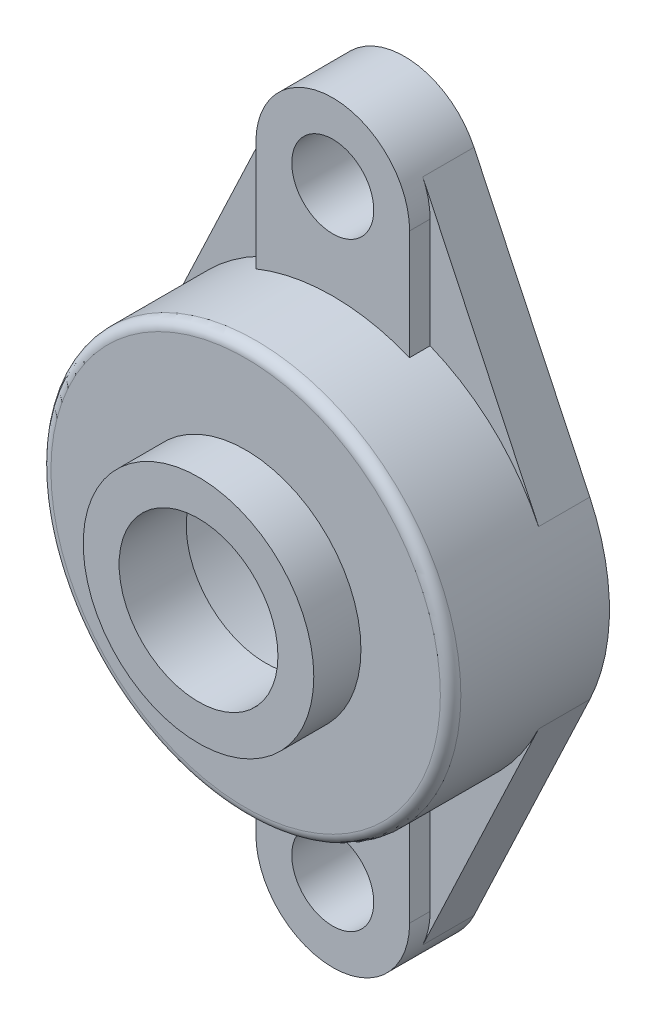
ISO-10303-21;
HEADER;
FILE_DESCRIPTION(('STEP AP214'),'2;1');
FILE_NAME('part.step','',(''),(''),'','','');
FILE_SCHEMA(('AUTOMOTIVE_DESIGN { 1 0 10303 214 1 1 1 1 }'));
ENDSEC;
DATA;
#1=APPLICATION_CONTEXT('core data for automotive mechanical design processes');
#2=APPLICATION_PROTOCOL_DEFINITION('international standard','automotive_design',2000,#1);
#3=PRODUCT_CONTEXT('',#1,'mechanical');
#4=PRODUCT('Part','Part','',(#3));
#5=PRODUCT_RELATED_PRODUCT_CATEGORY('part','',(#4));
#6=PRODUCT_DEFINITION_FORMATION('','',#4);
#7=PRODUCT_DEFINITION_CONTEXT('part definition',#1,'design');
#8=PRODUCT_DEFINITION('design','',#6,#7);
#9=PRODUCT_DEFINITION_SHAPE('','',#8);
#10=(LENGTH_UNIT() NAMED_UNIT(*) SI_UNIT(.MILLI.,.METRE.));
#11=(NAMED_UNIT(*) PLANE_ANGLE_UNIT() SI_UNIT($,.RADIAN.));
#12=(NAMED_UNIT(*) SI_UNIT($,.STERADIAN.) SOLID_ANGLE_UNIT());
#13=UNCERTAINTY_MEASURE_WITH_UNIT(LENGTH_MEASURE(1.E-05),#10,'distance_accuracy_value','');
#14=(GEOMETRIC_REPRESENTATION_CONTEXT(3) GLOBAL_UNCERTAINTY_ASSIGNED_CONTEXT((#13)) GLOBAL_UNIT_ASSIGNED_CONTEXT((#10,
#11,#12)) REPRESENTATION_CONTEXT('',''));
#15=CARTESIAN_POINT('',(0.,0.,0.));
#16=DIRECTION('',(0.,0.,1.));
#17=DIRECTION('',(1.,0.,0.));
#18=AXIS2_PLACEMENT_3D('',#15,#16,#17);
#19=CARTESIAN_POINT('',(0.,0.,-2.50000000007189E-05));
#20=DIRECTION('',(0.,0.,1.));
#21=DIRECTION('',(1.,0.,0.));
#22=AXIS2_PLACEMENT_3D('',#19,#20,#21);
#23=CYLINDRICAL_SURFACE('',#22,15.5);
#24=CARTESIAN_POINT('',(0.,0.,40.2));
#25=DIRECTION('',(0.,0.,1.));
#26=DIRECTION('',(1.,0.,0.));
#27=AXIS2_PLACEMENT_3D('',#24,#25,#26);
#28=CIRCLE('',#27,15.5);
#29=CARTESIAN_POINT('',(15.5,0.,40.2));
#30=VERTEX_POINT('',#29);
#31=EDGE_CURVE('E415',#30,#30,#28,.T.);
#32=CARTESIAN_POINT('',(0.,0.,27.1));
#33=DIRECTION('',(0.,0.,-1.));
#34=DIRECTION('',(0.,1.,0.));
#35=AXIS2_PLACEMENT_3D('',#32,#33,#34);
#36=CIRCLE('',#35,15.5);
#37=CARTESIAN_POINT('',(15.5,0.,27.1));
#38=VERTEX_POINT('',#37);
#39=EDGE_CURVE('E37',#38,#38,#36,.F.);
#40=CARTESIAN_POINT('',(15.5,0.,40.2));
#41=CARTESIAN_POINT('',(15.5,0.,40.0635416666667));
#42=CARTESIAN_POINT('',(15.5,0.,39.9270833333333));
#43=CARTESIAN_POINT('',(15.5,0.,39.6541666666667));
#44=CARTESIAN_POINT('',(15.5,0.,39.5177083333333));
#45=CARTESIAN_POINT('',(15.5,0.,39.2447916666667));
#46=CARTESIAN_POINT('',(15.5,0.,39.1083333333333));
#47=CARTESIAN_POINT('',(15.5,0.,38.8354166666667));
#48=CARTESIAN_POINT('',(15.5,0.,38.6989583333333));
#49=CARTESIAN_POINT('',(15.5,0.,38.4260416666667));
#50=CARTESIAN_POINT('',(15.5,0.,38.2895833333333));
#51=CARTESIAN_POINT('',(15.5,0.,38.0166666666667));
#52=CARTESIAN_POINT('',(15.5,0.,37.8802083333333));
#53=CARTESIAN_POINT('',(15.5,0.,37.6072916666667));
#54=CARTESIAN_POINT('',(15.5,0.,37.4708333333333));
#55=CARTESIAN_POINT('',(15.5,0.,37.1979166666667));
#56=CARTESIAN_POINT('',(15.5,0.,37.0614583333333));
#57=CARTESIAN_POINT('',(15.5,0.,36.7885416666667));
#58=CARTESIAN_POINT('',(15.5,0.,36.6520833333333));
#59=CARTESIAN_POINT('',(15.5,0.,36.3791666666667));
#60=CARTESIAN_POINT('',(15.5,0.,36.2427083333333));
#61=CARTESIAN_POINT('',(15.5,0.,35.9697916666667));
#62=CARTESIAN_POINT('',(15.5,0.,35.8333333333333));
#63=CARTESIAN_POINT('',(15.5,0.,35.5604166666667));
#64=CARTESIAN_POINT('',(15.5,0.,35.4239583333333));
#65=CARTESIAN_POINT('',(15.5,0.,35.1510416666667));
#66=CARTESIAN_POINT('',(15.5,0.,35.0145833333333));
#67=CARTESIAN_POINT('',(15.5,0.,34.7416666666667));
#68=CARTESIAN_POINT('',(15.5,0.,34.6052083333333));
#69=CARTESIAN_POINT('',(15.5,0.,34.3322916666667));
#70=CARTESIAN_POINT('',(15.5,0.,34.1958333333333));
#71=CARTESIAN_POINT('',(15.5,0.,33.9229166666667));
#72=CARTESIAN_POINT('',(15.5,0.,33.7864583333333));
#73=CARTESIAN_POINT('',(15.5,0.,33.5135416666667));
#74=CARTESIAN_POINT('',(15.5,0.,33.3770833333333));
#75=CARTESIAN_POINT('',(15.5,0.,33.1041666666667));
#76=CARTESIAN_POINT('',(15.5,0.,32.9677083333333));
#77=CARTESIAN_POINT('',(15.5,0.,32.6947916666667));
#78=CARTESIAN_POINT('',(15.5,0.,32.5583333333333));
#79=CARTESIAN_POINT('',(15.5,0.,32.2854166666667));
#80=CARTESIAN_POINT('',(15.5,0.,32.1489583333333));
#81=CARTESIAN_POINT('',(15.5,0.,31.8760416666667));
#82=CARTESIAN_POINT('',(15.5,0.,31.7395833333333));
#83=CARTESIAN_POINT('',(15.5,0.,31.4666666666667));
#84=CARTESIAN_POINT('',(15.5,0.,31.3302083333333));
#85=CARTESIAN_POINT('',(15.5,0.,31.0572916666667));
#86=CARTESIAN_POINT('',(15.5,0.,30.9208333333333));
#87=CARTESIAN_POINT('',(15.5,0.,30.6479166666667));
#88=CARTESIAN_POINT('',(15.5,0.,30.5114583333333));
#89=CARTESIAN_POINT('',(15.5,0.,30.2385416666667));
#90=CARTESIAN_POINT('',(15.5,0.,30.1020833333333));
#91=CARTESIAN_POINT('',(15.5,0.,29.8291666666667));
#92=CARTESIAN_POINT('',(15.5,0.,29.6927083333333));
#93=CARTESIAN_POINT('',(15.5,0.,29.4197916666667));
#94=CARTESIAN_POINT('',(15.5,0.,29.2833333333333));
#95=CARTESIAN_POINT('',(15.5,0.,29.0104166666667));
#96=CARTESIAN_POINT('',(15.5,0.,28.8739583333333));
#97=CARTESIAN_POINT('',(15.5,0.,28.6010416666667));
#98=CARTESIAN_POINT('',(15.5,0.,28.4645833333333));
#99=CARTESIAN_POINT('',(15.5,0.,28.1916666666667));
#100=CARTESIAN_POINT('',(15.5,0.,28.0552083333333));
#101=CARTESIAN_POINT('',(15.5,0.,27.7822916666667));
#102=CARTESIAN_POINT('',(15.5,0.,27.6458333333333));
#103=CARTESIAN_POINT('',(15.5,0.,27.3729166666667));
#104=CARTESIAN_POINT('',(15.5,0.,27.2364583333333));
#105=CARTESIAN_POINT('',(15.5,0.,27.1));
#106=B_SPLINE_CURVE_WITH_KNOTS('',3,(#40,#41,#42,#43,#44,#45,#46,#47,#48,#49,#50,#51,#52,#53,
#54,#55,#56,#57,#58,#59,#60,#61,#62,#63,#64,#65,#66,#67,#68,#69,#70,#71,#72,#73,#74,#75,#76,#77,
#78,#79,#80,#81,#82,#83,#84,#85,#86,#87,#88,#89,#90,#91,#92,#93,#94,#95,#96,#97,#98,#99,#100,
#101,#102,#103,#104,#105),.UNSPECIFIED.,.F.,.F.,(4,2,2,2,2,2,2,2,2,2,2,2,2,2,2,2,2,2,2,2,2,2,2,
2,2,2,2,2,2,2,2,2,4),(0.,0.409374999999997,0.81875,1.228125,1.6375,2.046875,2.45625,2.865625,
3.275,3.684375,4.09375,4.503125,4.9125,5.321875,5.73124999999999,6.140625,6.55,6.959375,
7.36874999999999,7.778125,8.1875,8.596875,9.00624999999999,9.41562499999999,9.82499999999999,
10.234375,10.64375,11.053125,11.4625,11.871875,12.28125,12.690625,13.1),.UNSPECIFIED.);
#107=EDGE_CURVE('BSEAM33',#30,#38,#106,.T.);
#108=ORIENTED_EDGE('',*,*,#31,.T.);
#109=ORIENTED_EDGE('',*,*,#39,.F.);
#110=ORIENTED_EDGE('',*,*,#107,.T.);
#111=ORIENTED_EDGE('',*,*,#107,.F.);
#112=EDGE_LOOP('',(#108,#110,#109,#111));
#113=FACE_BOUND('',#112,.T.);
#114=ADVANCED_FACE('F33',(#113),#23,.F.);
#115=CARTESIAN_POINT('',(0.,0.,10.));
#116=DIRECTION('',(0.,0.,-1.));
#117=DIRECTION('',(-1.,0.,0.));
#118=AXIS2_PLACEMENT_3D('',#115,#116,#117);
#119=PLANE('',#118);
#120=CARTESIAN_POINT('',(0.,58.5,10.));
#121=DIRECTION('',(0.,0.,1.));
#122=DIRECTION('',(1.,0.,0.));
#123=AXIS2_PLACEMENT_3D('',#120,#121,#122);
#124=CIRCLE('',#123,15.);
#125=CARTESIAN_POINT('',(-13.5612909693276,64.9102564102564,10.));
#126=VERTEX_POINT('',#125);
#127=CARTESIAN_POINT('',(-15.,58.5,10.));
#128=VERTEX_POINT('',#127);
#129=EDGE_CURVE('E414',#126,#128,#124,.T.);
#130=ORIENTED_EDGE('',*,*,#129,.F.);
#131=DIRECTION('',(-0.427350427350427,-0.904086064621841,0.));
#132=VECTOR('',#131,1.);
#133=CARTESIAN_POINT('',(-36.1634425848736,17.0940170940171,10.));
#134=LINE('',#133,#132);
#135=CARTESIAN_POINT('',(-36.1634425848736,17.0940170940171,10.));
#136=VERTEX_POINT('',#135);
#137=EDGE_CURVE('E403',#126,#136,#134,.T.);
#138=ORIENTED_EDGE('',*,*,#137,.T.);
#139=CARTESIAN_POINT('',(0.,0.,10.));
#140=DIRECTION('',(0.,0.,1.));
#141=DIRECTION('',(1.,0.,0.));
#142=AXIS2_PLACEMENT_3D('',#139,#140,#141);
#143=CIRCLE('',#142,40.);
#144=CARTESIAN_POINT('',(-15.,37.0809924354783,10.));
#145=VERTEX_POINT('',#144);
#146=EDGE_CURVE('E206',#145,#136,#143,.T.);
#147=ORIENTED_EDGE('',*,*,#146,.F.);
#148=DIRECTION('',(0.,-1.,0.));
#149=VECTOR('',#148,1.);
#150=CARTESIAN_POINT('',(-15.,58.5,10.));
#151=LINE('',#150,#149);
#152=EDGE_CURVE('E49',#128,#145,#151,.T.);
#153=ORIENTED_EDGE('',*,*,#152,.F.);
#154=EDGE_LOOP('',(#130,#138,#147,#153));
#155=FACE_BOUND('',#154,.T.);
#156=ADVANCED_FACE('F283',(#155),#119,.F.);
#157=CARTESIAN_POINT('',(15.,58.5,10.));
#158=VERTEX_POINT('',#157);
#159=CARTESIAN_POINT('',(13.5612909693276,64.9102564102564,10.));
#160=VERTEX_POINT('',#159);
#161=EDGE_CURVE('E57',#158,#160,#124,.T.);
#162=ORIENTED_EDGE('',*,*,#161,.F.);
#163=DIRECTION('',(0.,1.,0.));
#164=VECTOR('',#163,1.);
#165=CARTESIAN_POINT('',(15.,58.5,10.));
#166=LINE('',#165,#164);
#167=CARTESIAN_POINT('',(15.,37.0809924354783,10.));
#168=VERTEX_POINT('',#167);
#169=EDGE_CURVE('E175',#168,#158,#166,.T.);
#170=ORIENTED_EDGE('',*,*,#169,.F.);
#171=CARTESIAN_POINT('',(36.1634425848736,17.0940170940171,10.));
#172=VERTEX_POINT('',#171);
#173=EDGE_CURVE('E207',#172,#168,#143,.T.);
#174=ORIENTED_EDGE('',*,*,#173,.F.);
#175=DIRECTION('',(-0.427350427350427,0.904086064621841,0.));
#176=VECTOR('',#175,1.);
#177=CARTESIAN_POINT('',(36.1634425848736,17.0940170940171,10.));
#178=LINE('',#177,#176);
#179=EDGE_CURVE('E218',#172,#160,#178,.T.);
#180=ORIENTED_EDGE('',*,*,#179,.T.);
#181=EDGE_LOOP('',(#162,#170,#174,#180));
#182=FACE_BOUND('',#181,.T.);
#183=ADVANCED_FACE('F289',(#182),#119,.F.);
#184=CARTESIAN_POINT('',(-15.,-37.0809924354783,10.));
#185=VERTEX_POINT('',#184);
#186=CARTESIAN_POINT('',(-15.,-58.5,10.));
#187=VERTEX_POINT('',#186);
#188=EDGE_CURVE('E149',#185,#187,#151,.T.);
#189=ORIENTED_EDGE('',*,*,#188,.F.);
#190=CARTESIAN_POINT('',(-36.1634425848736,-17.0940170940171,10.));
#191=VERTEX_POINT('',#190);
#192=EDGE_CURVE('E225',#191,#185,#143,.T.);
#193=ORIENTED_EDGE('',*,*,#192,.F.);
#194=DIRECTION('',(0.427350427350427,-0.904086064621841,0.));
#195=VECTOR('',#194,1.);
#196=CARTESIAN_POINT('',(-36.1634425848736,-17.0940170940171,10.));
#197=LINE('',#196,#195);
#198=CARTESIAN_POINT('',(-13.5612909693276,-64.9102564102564,10.));
#199=VERTEX_POINT('',#198);
#200=EDGE_CURVE('E173',#191,#199,#197,.T.);
#201=ORIENTED_EDGE('',*,*,#200,.T.);
#202=CARTESIAN_POINT('',(0.,-58.5,10.));
#203=DIRECTION('',(0.,0.,1.));
#204=DIRECTION('',(-1.,0.,0.));
#205=AXIS2_PLACEMENT_3D('',#202,#203,#204);
#206=CIRCLE('',#205,15.);
#207=EDGE_CURVE('E164',#187,#199,#206,.T.);
#208=ORIENTED_EDGE('',*,*,#207,.F.);
#209=EDGE_LOOP('',(#189,#193,#201,#208));
#210=FACE_BOUND('',#209,.T.);
#211=ADVANCED_FACE('F171',(#210),#119,.F.);
#212=CARTESIAN_POINT('',(13.5612909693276,-64.9102564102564,10.));
#213=VERTEX_POINT('',#212);
#214=CARTESIAN_POINT('',(15.,-58.5,10.));
#215=VERTEX_POINT('',#214);
#216=EDGE_CURVE('E176',#213,#215,#206,.T.);
#217=ORIENTED_EDGE('',*,*,#216,.F.);
#218=DIRECTION('',(0.427350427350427,0.904086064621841,0.));
#219=VECTOR('',#218,1.);
#220=CARTESIAN_POINT('',(36.1634425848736,-17.0940170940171,10.));
#221=LINE('',#220,#219);
#222=CARTESIAN_POINT('',(36.1634425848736,-17.0940170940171,10.));
#223=VERTEX_POINT('',#222);
#224=EDGE_CURVE('E397',#213,#223,#221,.T.);
#225=ORIENTED_EDGE('',*,*,#224,.T.);
#226=CARTESIAN_POINT('',(15.,-37.0809924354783,10.));
#227=VERTEX_POINT('',#226);
#228=EDGE_CURVE('E232',#227,#223,#143,.T.);
#229=ORIENTED_EDGE('',*,*,#228,.F.);
#230=EDGE_CURVE('E178',#215,#227,#166,.T.);
#231=ORIENTED_EDGE('',*,*,#230,.F.);
#232=EDGE_LOOP('',(#217,#225,#229,#231));
#233=FACE_BOUND('',#232,.T.);
#234=ADVANCED_FACE('F291',(#233),#119,.F.);
#235=CARTESIAN_POINT('',(0.,0.,10.));
#236=DIRECTION('',(0.,0.,-1.));
#237=DIRECTION('',(-1.,0.,0.));
#238=AXIS2_PLACEMENT_3D('',#235,#236,#237);
#239=CYLINDRICAL_SURFACE('',#238,40.);
#240=CARTESIAN_POINT('',(0.,0.,29.));
#241=DIRECTION('',(0.,0.,1.));
#242=DIRECTION('',(1.,0.,0.));
#243=AXIS2_PLACEMENT_3D('',#240,#241,#242);
#244=CIRCLE('',#243,40.);
#245=CARTESIAN_POINT('',(40.,0.,29.));
#246=VERTEX_POINT('',#245);
#247=EDGE_CURVE('E11',#246,#246,#244,.F.);
#248=ORIENTED_EDGE('',*,*,#247,.T.);
#249=EDGE_LOOP('',(#248));
#250=FACE_BOUND('',#249,.T.);
#251=DIRECTION('',(0.,0.,-1.));
#252=VECTOR('',#251,1.);
#253=CARTESIAN_POINT('',(-15.,37.0809924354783,10.));
#254=LINE('',#253,#252);
#255=CARTESIAN_POINT('',(-15.,37.0809924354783,14.));
#256=VERTEX_POINT('',#255);
#257=EDGE_CURVE('E246',#145,#256,#254,.F.);
#258=ORIENTED_EDGE('',*,*,#257,.F.);
#259=ORIENTED_EDGE('',*,*,#146,.T.);
#260=DIRECTION('',(0.,0.,-1.));
#261=VECTOR('',#260,1.);
#262=CARTESIAN_POINT('',(-36.1634425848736,17.0940170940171,10.));
#263=LINE('',#262,#261);
#264=CARTESIAN_POINT('',(-36.1634425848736,17.0940170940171,0.));
#265=VERTEX_POINT('',#264);
#266=EDGE_CURVE('E380',#136,#265,#263,.T.);
#267=ORIENTED_EDGE('',*,*,#266,.T.);
#268=CARTESIAN_POINT('',(0.,0.,0.));
#269=DIRECTION('',(0.,0.,1.));
#270=DIRECTION('',(-1.,0.,0.));
#271=AXIS2_PLACEMENT_3D('',#268,#269,#270);
#272=CIRCLE('',#271,40.);
#273=CARTESIAN_POINT('',(-36.1634425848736,-17.0940170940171,0.));
#274=VERTEX_POINT('',#273);
#275=EDGE_CURVE('E211',#265,#274,#272,.T.);
#276=ORIENTED_EDGE('',*,*,#275,.T.);
#277=DIRECTION('',(0.,0.,-1.));
#278=VECTOR('',#277,1.);
#279=CARTESIAN_POINT('',(-36.1634425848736,-17.0940170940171,10.));
#280=LINE('',#279,#278);
#281=EDGE_CURVE('E234',#191,#274,#280,.T.);
#282=ORIENTED_EDGE('',*,*,#281,.F.);
#283=ORIENTED_EDGE('',*,*,#192,.T.);
#284=DIRECTION('',(0.,0.,-1.));
#285=VECTOR('',#284,1.);
#286=CARTESIAN_POINT('',(-15.,-37.0809924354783,10.));
#287=LINE('',#286,#285);
#288=CARTESIAN_POINT('',(-15.,-37.0809924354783,14.));
#289=VERTEX_POINT('',#288);
#290=EDGE_CURVE('E156',#289,#185,#287,.T.);
#291=ORIENTED_EDGE('',*,*,#290,.F.);
#292=CARTESIAN_POINT('',(0.,0.,14.));
#293=DIRECTION('',(0.,0.,1.));
#294=DIRECTION('',(1.,0.,0.));
#295=AXIS2_PLACEMENT_3D('',#292,#293,#294);
#296=CIRCLE('',#295,40.);
#297=CARTESIAN_POINT('',(15.,-37.0809924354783,14.));
#298=VERTEX_POINT('',#297);
#299=EDGE_CURVE('E235',#289,#298,#296,.T.);
#300=ORIENTED_EDGE('',*,*,#299,.T.);
#301=DIRECTION('',(0.,0.,-1.));
#302=VECTOR('',#301,1.);
#303=CARTESIAN_POINT('',(15.,-37.0809924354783,10.));
#304=LINE('',#303,#302);
#305=EDGE_CURVE('E238',#227,#298,#304,.F.);
#306=ORIENTED_EDGE('',*,*,#305,.F.);
#307=ORIENTED_EDGE('',*,*,#228,.T.);
#308=DIRECTION('',(0.,0.,-1.));
#309=VECTOR('',#308,1.);
#310=CARTESIAN_POINT('',(36.1634425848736,-17.0940170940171,10.));
#311=LINE('',#310,#309);
#312=CARTESIAN_POINT('',(36.1634425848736,-17.0940170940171,0.));
#313=VERTEX_POINT('',#312);
#314=EDGE_CURVE('E383',#223,#313,#311,.T.);
#315=ORIENTED_EDGE('',*,*,#314,.T.);
#316=CARTESIAN_POINT('',(0.,0.,0.));
#317=DIRECTION('',(0.,0.,1.));
#318=DIRECTION('',(1.,0.,0.));
#319=AXIS2_PLACEMENT_3D('',#316,#317,#318);
#320=CIRCLE('',#319,40.);
#321=CARTESIAN_POINT('',(36.1634425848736,17.0940170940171,0.));
#322=VERTEX_POINT('',#321);
#323=EDGE_CURVE('E366',#313,#322,#320,.T.);
#324=ORIENTED_EDGE('',*,*,#323,.T.);
#325=DIRECTION('',(0.,0.,-1.));
#326=VECTOR('',#325,1.);
#327=CARTESIAN_POINT('',(36.1634425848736,17.0940170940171,10.));
#328=LINE('',#327,#326);
#329=EDGE_CURVE('E382',#172,#322,#328,.T.);
#330=ORIENTED_EDGE('',*,*,#329,.F.);
#331=ORIENTED_EDGE('',*,*,#173,.T.);
#332=DIRECTION('',(0.,0.,-1.));
#333=VECTOR('',#332,1.);
#334=CARTESIAN_POINT('',(15.,37.0809924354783,10.));
#335=LINE('',#334,#333);
#336=CARTESIAN_POINT('',(15.,37.0809924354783,14.));
#337=VERTEX_POINT('',#336);
#338=EDGE_CURVE('E243',#337,#168,#335,.T.);
#339=ORIENTED_EDGE('',*,*,#338,.F.);
#340=EDGE_CURVE('E239',#337,#256,#296,.T.);
#341=ORIENTED_EDGE('',*,*,#340,.T.);
#342=EDGE_LOOP('',(#258,#259,#267,#276,#282,#283,#291,#300,#306,#307,#315,#324,#330,#331,#339,#341));
#343=FACE_BOUND('',#342,.T.);
#344=ADVANCED_FACE('F322',(#250,#343),#239,.T.);
#345=CARTESIAN_POINT('',(0.,0.,31.));
#346=DIRECTION('',(0.,0.,1.));
#347=DIRECTION('',(1.,0.,0.));
#348=AXIS2_PLACEMENT_3D('',#345,#346,#347);
#349=PLANE('',#348);
#350=CARTESIAN_POINT('',(0.,0.,31.));
#351=DIRECTION('',(0.,0.,1.));
#352=DIRECTION('',(1.,0.,0.));
#353=AXIS2_PLACEMENT_3D('',#350,#351,#352);
#354=CIRCLE('',#353,38.);
#355=CARTESIAN_POINT('',(38.,0.,31.));
#356=VERTEX_POINT('',#355);
#357=EDGE_CURVE('E42',#356,#356,#354,.T.);
#358=ORIENTED_EDGE('',*,*,#357,.T.);
#359=EDGE_LOOP('',(#358));
#360=FACE_BOUND('',#359,.T.);
#361=CARTESIAN_POINT('',(0.,0.,31.));
#362=DIRECTION('',(0.,0.,1.));
#363=DIRECTION('',(1.,0.,0.));
#364=AXIS2_PLACEMENT_3D('',#361,#362,#363);
#365=CIRCLE('',#364,22.5);
#366=CARTESIAN_POINT('',(22.5,0.,31.));
#367=VERTEX_POINT('',#366);
#368=EDGE_CURVE('E200',#367,#367,#365,.T.);
#369=ORIENTED_EDGE('',*,*,#368,.F.);
#370=EDGE_LOOP('',(#369));
#371=FACE_BOUND('',#370,.T.);
#372=ADVANCED_FACE('F261',(#360,#371),#349,.T.);
#373=CARTESIAN_POINT('',(-36.1634425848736,-17.0940170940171,10.));
#374=DIRECTION('',(0.904086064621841,0.427350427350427,0.));
#375=DIRECTION('',(-0.427350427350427,0.904086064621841,0.));
#376=AXIS2_PLACEMENT_3D('',#373,#374,#375);
#377=PLANE('',#376);
#378=DIRECTION('',(0.427350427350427,-0.904086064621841,0.));
#379=VECTOR('',#378,1.);
#380=CARTESIAN_POINT('',(-36.1634425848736,-17.0940170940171,0.));
#381=LINE('',#380,#379);
#382=CARTESIAN_POINT('',(-13.5612909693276,-64.9102564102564,0.));
#383=VERTEX_POINT('',#382);
#384=EDGE_CURVE('E352',#274,#383,#381,.T.);
#385=ORIENTED_EDGE('',*,*,#384,.T.);
#386=DIRECTION('',(0.,0.,-1.));
#387=VECTOR('',#386,1.);
#388=CARTESIAN_POINT('',(-13.5612909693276,-64.9102564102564,10.));
#389=LINE('',#388,#387);
#390=EDGE_CURVE('E216',#199,#383,#389,.T.);
#391=ORIENTED_EDGE('',*,*,#390,.F.);
#392=ORIENTED_EDGE('',*,*,#200,.F.);
#393=ORIENTED_EDGE('',*,*,#281,.T.);
#394=EDGE_LOOP('',(#385,#391,#392,#393));
#395=FACE_BOUND('',#394,.T.);
#396=ADVANCED_FACE('F35',(#395),#377,.F.);
#397=CARTESIAN_POINT('',(0.,-58.5,10.));
#398=DIRECTION('',(0.,0.,-1.));
#399=DIRECTION('',(-1.,0.,0.));
#400=AXIS2_PLACEMENT_3D('',#397,#398,#399);
#401=CYLINDRICAL_SURFACE('',#400,15.);
#402=CARTESIAN_POINT('',(0.,-58.5,0.));
#403=DIRECTION('',(0.,0.,1.));
#404=DIRECTION('',(1.,0.,0.));
#405=AXIS2_PLACEMENT_3D('',#402,#403,#404);
#406=CIRCLE('',#405,15.);
#407=CARTESIAN_POINT('',(13.5612909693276,-64.9102564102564,0.));
#408=VERTEX_POINT('',#407);
#409=EDGE_CURVE('E358',#383,#408,#406,.T.);
#410=ORIENTED_EDGE('',*,*,#409,.T.);
#411=DIRECTION('',(0.,0.,-1.));
#412=VECTOR('',#411,1.);
#413=CARTESIAN_POINT('',(13.5612909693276,-64.9102564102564,10.));
#414=LINE('',#413,#412);
#415=EDGE_CURVE('E361',#213,#408,#414,.T.);
#416=ORIENTED_EDGE('',*,*,#415,.F.);
#417=ORIENTED_EDGE('',*,*,#216,.T.);
#418=DIRECTION('',(0.,0.,-1.));
#419=VECTOR('',#418,1.);
#420=CARTESIAN_POINT('',(15.,-58.5,14.));
#421=LINE('',#420,#419);
#422=CARTESIAN_POINT('',(15.,-58.5,14.));
#423=VERTEX_POINT('',#422);
#424=EDGE_CURVE('E169',#423,#215,#421,.T.);
#425=ORIENTED_EDGE('',*,*,#424,.F.);
#426=CARTESIAN_POINT('',(0.,-58.5,14.));
#427=DIRECTION('',(0.,0.,1.));
#428=DIRECTION('',(-1.,0.,0.));
#429=AXIS2_PLACEMENT_3D('',#426,#427,#428);
#430=CIRCLE('',#429,15.);
#431=CARTESIAN_POINT('',(-15.,-58.5,14.));
#432=VERTEX_POINT('',#431);
#433=EDGE_CURVE('E167',#432,#423,#430,.T.);
#434=ORIENTED_EDGE('',*,*,#433,.F.);
#435=DIRECTION('',(0.,0.,-1.));
#436=VECTOR('',#435,1.);
#437=CARTESIAN_POINT('',(-15.,-58.5,14.));
#438=LINE('',#437,#436);
#439=EDGE_CURVE('E153',#432,#187,#438,.T.);
#440=ORIENTED_EDGE('',*,*,#439,.T.);
#441=ORIENTED_EDGE('',*,*,#207,.T.);
#442=ORIENTED_EDGE('',*,*,#390,.T.);
#443=EDGE_LOOP('',(#410,#416,#417,#425,#434,#440,#441,#442));
#444=FACE_BOUND('',#443,.T.);
#445=ADVANCED_FACE('F162',(#444),#401,.T.);
#446=CARTESIAN_POINT('',(36.1634425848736,-17.0940170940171,10.));
#447=DIRECTION('',(-0.904086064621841,0.427350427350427,0.));
#448=DIRECTION('',(-0.427350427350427,-0.904086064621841,0.));
#449=AXIS2_PLACEMENT_3D('',#446,#447,#448);
#450=PLANE('',#449);
#451=DIRECTION('',(0.427350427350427,0.904086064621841,0.));
#452=VECTOR('',#451,1.);
#453=CARTESIAN_POINT('',(36.1634425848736,-17.0940170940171,0.));
#454=LINE('',#453,#452);
#455=EDGE_CURVE('E364',#408,#313,#454,.T.);
#456=ORIENTED_EDGE('',*,*,#455,.T.);
#457=ORIENTED_EDGE('',*,*,#314,.F.);
#458=ORIENTED_EDGE('',*,*,#224,.F.);
#459=ORIENTED_EDGE('',*,*,#415,.T.);
#460=EDGE_LOOP('',(#456,#457,#458,#459));
#461=FACE_BOUND('',#460,.T.);
#462=ADVANCED_FACE('F337',(#461),#450,.F.);
#463=CARTESIAN_POINT('',(36.1634425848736,17.0940170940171,10.));
#464=DIRECTION('',(-0.904086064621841,-0.427350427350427,0.));
#465=DIRECTION('',(0.427350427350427,-0.904086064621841,0.));
#466=AXIS2_PLACEMENT_3D('',#463,#464,#465);
#467=PLANE('',#466);
#468=DIRECTION('',(-0.427350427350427,0.904086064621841,0.));
#469=VECTOR('',#468,1.);
#470=CARTESIAN_POINT('',(36.1634425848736,17.0940170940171,0.));
#471=LINE('',#470,#469);
#472=CARTESIAN_POINT('',(13.5612909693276,64.9102564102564,0.));
#473=VERTEX_POINT('',#472);
#474=EDGE_CURVE('E370',#322,#473,#471,.T.);
#475=ORIENTED_EDGE('',*,*,#474,.T.);
#476=DIRECTION('',(0.,0.,-1.));
#477=VECTOR('',#476,1.);
#478=CARTESIAN_POINT('',(13.5612909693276,64.9102564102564,10.));
#479=LINE('',#478,#477);
#480=EDGE_CURVE('E379',#160,#473,#479,.T.);
#481=ORIENTED_EDGE('',*,*,#480,.F.);
#482=ORIENTED_EDGE('',*,*,#179,.F.);
#483=ORIENTED_EDGE('',*,*,#329,.T.);
#484=EDGE_LOOP('',(#475,#481,#482,#483));
#485=FACE_BOUND('',#484,.T.);
#486=ADVANCED_FACE('F333',(#485),#467,.F.);
#487=CARTESIAN_POINT('',(0.,58.5,10.));
#488=DIRECTION('',(0.,0.,-1.));
#489=DIRECTION('',(-1.,0.,0.));
#490=AXIS2_PLACEMENT_3D('',#487,#488,#489);
#491=CYLINDRICAL_SURFACE('',#490,15.);
#492=CARTESIAN_POINT('',(0.,58.5,0.));
#493=DIRECTION('',(0.,0.,1.));
#494=DIRECTION('',(-1.,0.,0.));
#495=AXIS2_PLACEMENT_3D('',#492,#493,#494);
#496=CIRCLE('',#495,15.);
#497=CARTESIAN_POINT('',(-13.5612909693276,64.9102564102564,0.));
#498=VERTEX_POINT('',#497);
#499=EDGE_CURVE('E372',#473,#498,#496,.T.);
#500=ORIENTED_EDGE('',*,*,#499,.T.);
#501=DIRECTION('',(0.,0.,-1.));
#502=VECTOR('',#501,1.);
#503=CARTESIAN_POINT('',(-13.5612909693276,64.9102564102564,10.));
#504=LINE('',#503,#502);
#505=EDGE_CURVE('E376',#126,#498,#504,.T.);
#506=ORIENTED_EDGE('',*,*,#505,.F.);
#507=ORIENTED_EDGE('',*,*,#129,.T.);
#508=DIRECTION('',(0.,0.,-1.));
#509=VECTOR('',#508,1.);
#510=CARTESIAN_POINT('',(-15.,58.5,14.));
#511=LINE('',#510,#509);
#512=CARTESIAN_POINT('',(-15.,58.5,14.));
#513=VERTEX_POINT('',#512);
#514=EDGE_CURVE('E168',#513,#128,#511,.T.);
#515=ORIENTED_EDGE('',*,*,#514,.F.);
#516=CARTESIAN_POINT('',(0.,58.5,14.));
#517=DIRECTION('',(0.,0.,1.));
#518=DIRECTION('',(1.,0.,0.));
#519=AXIS2_PLACEMENT_3D('',#516,#517,#518);
#520=CIRCLE('',#519,15.);
#521=CARTESIAN_POINT('',(15.,58.5,14.));
#522=VERTEX_POINT('',#521);
#523=EDGE_CURVE('E182',#522,#513,#520,.T.);
#524=ORIENTED_EDGE('',*,*,#523,.F.);
#525=DIRECTION('',(0.,0.,-1.));
#526=VECTOR('',#525,1.);
#527=CARTESIAN_POINT('',(15.,58.5,14.));
#528=LINE('',#527,#526);
#529=EDGE_CURVE('E193',#522,#158,#528,.T.);
#530=ORIENTED_EDGE('',*,*,#529,.T.);
#531=ORIENTED_EDGE('',*,*,#161,.T.);
#532=ORIENTED_EDGE('',*,*,#480,.T.);
#533=EDGE_LOOP('',(#500,#506,#507,#515,#524,#530,#531,#532));
#534=FACE_BOUND('',#533,.T.);
#535=ADVANCED_FACE('F329',(#534),#491,.T.);
#536=CARTESIAN_POINT('',(-36.1634425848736,17.0940170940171,10.));
#537=DIRECTION('',(0.904086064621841,-0.427350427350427,0.));
#538=DIRECTION('',(0.427350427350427,0.904086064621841,0.));
#539=AXIS2_PLACEMENT_3D('',#536,#537,#538);
#540=PLANE('',#539);
#541=DIRECTION('',(-0.427350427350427,-0.904086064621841,0.));
#542=VECTOR('',#541,1.);
#543=CARTESIAN_POINT('',(-36.1634425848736,17.0940170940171,0.));
#544=LINE('',#543,#542);
#545=EDGE_CURVE('E374',#498,#265,#544,.T.);
#546=ORIENTED_EDGE('',*,*,#545,.T.);
#547=ORIENTED_EDGE('',*,*,#266,.F.);
#548=ORIENTED_EDGE('',*,*,#137,.F.);
#549=ORIENTED_EDGE('',*,*,#505,.T.);
#550=EDGE_LOOP('',(#546,#547,#548,#549));
#551=FACE_BOUND('',#550,.T.);
#552=ADVANCED_FACE('F324',(#551),#540,.F.);
#553=CARTESIAN_POINT('',(0.,0.,0.));
#554=DIRECTION('',(0.,0.,-1.));
#555=DIRECTION('',(-1.,0.,0.));
#556=AXIS2_PLACEMENT_3D('',#553,#554,#555);
#557=PLANE('',#556);
#558=CARTESIAN_POINT('',(0.,-58.5,0.));
#559=DIRECTION('',(0.,0.,-1.));
#560=DIRECTION('',(-1.,0.,0.));
#561=AXIS2_PLACEMENT_3D('',#558,#559,#560);
#562=CIRCLE('',#561,8.);
#563=CARTESIAN_POINT('',(-8.,-58.5,0.));
#564=VERTEX_POINT('',#563);
#565=EDGE_CURVE('E257',#564,#564,#562,.T.);
#566=ORIENTED_EDGE('',*,*,#565,.F.);
#567=EDGE_LOOP('',(#566));
#568=FACE_BOUND('',#567,.T.);
#569=CARTESIAN_POINT('',(0.,58.5,0.));
#570=DIRECTION('',(0.,0.,-1.));
#571=DIRECTION('',(-1.,0.,0.));
#572=AXIS2_PLACEMENT_3D('',#569,#570,#571);
#573=CIRCLE('',#572,8.);
#574=CARTESIAN_POINT('',(-8.,58.5,0.));
#575=VERTEX_POINT('',#574);
#576=EDGE_CURVE('E253',#575,#575,#573,.T.);
#577=ORIENTED_EDGE('',*,*,#576,.F.);
#578=EDGE_LOOP('',(#577));
#579=FACE_BOUND('',#578,.T.);
#580=CARTESIAN_POINT('',(0.,0.,0.));
#581=DIRECTION('',(0.,0.,-1.));
#582=DIRECTION('',(-1.,0.,0.));
#583=AXIS2_PLACEMENT_3D('',#580,#581,#582);
#584=CIRCLE('',#583,36.);
#585=CARTESIAN_POINT('',(-36.,0.,0.));
#586=VERTEX_POINT('',#585);
#587=EDGE_CURVE('E252',#586,#586,#584,.T.);
#588=ORIENTED_EDGE('',*,*,#587,.F.);
#589=EDGE_LOOP('',(#588));
#590=FACE_BOUND('',#589,.T.);
#591=ORIENTED_EDGE('',*,*,#275,.F.);
#592=ORIENTED_EDGE('',*,*,#545,.F.);
#593=ORIENTED_EDGE('',*,*,#499,.F.);
#594=ORIENTED_EDGE('',*,*,#474,.F.);
#595=ORIENTED_EDGE('',*,*,#323,.F.);
#596=ORIENTED_EDGE('',*,*,#455,.F.);
#597=ORIENTED_EDGE('',*,*,#409,.F.);
#598=ORIENTED_EDGE('',*,*,#384,.F.);
#599=EDGE_LOOP('',(#591,#592,#593,#594,#595,#596,#597,#598));
#600=FACE_BOUND('',#599,.T.);
#601=ADVANCED_FACE('F318',(#568,#579,#590,#600),#557,.T.);
#602=CARTESIAN_POINT('',(0.,0.,40.2));
#603=DIRECTION('',(0.,0.,-1.));
#604=DIRECTION('',(-1.,0.,0.));
#605=AXIS2_PLACEMENT_3D('',#602,#603,#604);
#606=CYLINDRICAL_SURFACE('',#605,22.5);
#607=CARTESIAN_POINT('',(0.,0.,40.2));
#608=DIRECTION('',(0.,0.,1.));
#609=DIRECTION('',(1.,0.,0.));
#610=AXIS2_PLACEMENT_3D('',#607,#608,#609);
#611=CIRCLE('',#610,22.5);
#612=CARTESIAN_POINT('',(22.5,0.,40.2));
#613=VERTEX_POINT('',#612);
#614=EDGE_CURVE('E203',#613,#613,#611,.T.);
#615=ORIENTED_EDGE('',*,*,#614,.F.);
#616=EDGE_LOOP('',(#615));
#617=FACE_BOUND('',#616,.T.);
#618=ORIENTED_EDGE('',*,*,#368,.T.);
#619=EDGE_LOOP('',(#618));
#620=FACE_BOUND('',#619,.T.);
#621=ADVANCED_FACE('F314',(#617,#620),#606,.T.);
#622=CARTESIAN_POINT('',(0.,0.,40.2));
#623=DIRECTION('',(0.,0.,1.));
#624=DIRECTION('',(1.,0.,0.));
#625=AXIS2_PLACEMENT_3D('',#622,#623,#624);
#626=PLANE('',#625);
#627=ORIENTED_EDGE('',*,*,#31,.F.);
#628=EDGE_LOOP('',(#627));
#629=FACE_BOUND('',#628,.T.);
#630=ORIENTED_EDGE('',*,*,#614,.T.);
#631=EDGE_LOOP('',(#630));
#632=FACE_BOUND('',#631,.T.);
#633=ADVANCED_FACE('F302',(#629,#632),#626,.T.);
#634=CARTESIAN_POINT('',(0.,58.5,14.));
#635=DIRECTION('',(0.,0.,1.));
#636=DIRECTION('',(1.,0.,0.));
#637=AXIS2_PLACEMENT_3D('',#634,#635,#636);
#638=PLANE('',#637);
#639=CARTESIAN_POINT('',(0.,58.5,14.));
#640=DIRECTION('',(0.,0.,1.));
#641=DIRECTION('',(1.,0.,0.));
#642=AXIS2_PLACEMENT_3D('',#639,#640,#641);
#643=CIRCLE('',#642,8.);
#644=CARTESIAN_POINT('',(8.,58.5,14.));
#645=VERTEX_POINT('',#644);
#646=EDGE_CURVE('E249',#645,#645,#643,.T.);
#647=ORIENTED_EDGE('',*,*,#646,.F.);
#648=EDGE_LOOP('',(#647));
#649=FACE_BOUND('',#648,.T.);
#650=ORIENTED_EDGE('',*,*,#340,.F.);
#651=DIRECTION('',(0.,1.,0.));
#652=VECTOR('',#651,1.);
#653=CARTESIAN_POINT('',(15.,58.5,14.));
#654=LINE('',#653,#652);
#655=EDGE_CURVE('E190',#337,#522,#654,.T.);
#656=ORIENTED_EDGE('',*,*,#655,.T.);
#657=ORIENTED_EDGE('',*,*,#523,.T.);
#658=DIRECTION('',(0.,-1.,0.));
#659=VECTOR('',#658,1.);
#660=CARTESIAN_POINT('',(-15.,58.5,14.));
#661=LINE('',#660,#659);
#662=EDGE_CURVE('E186',#513,#256,#661,.T.);
#663=ORIENTED_EDGE('',*,*,#662,.T.);
#664=EDGE_LOOP('',(#650,#656,#657,#663));
#665=FACE_BOUND('',#664,.T.);
#666=ADVANCED_FACE('F298',(#649,#665),#638,.T.);
#667=CARTESIAN_POINT('',(15.,58.5,14.));
#668=DIRECTION('',(-1.,0.,0.));
#669=DIRECTION('',(0.,0.,1.));
#670=AXIS2_PLACEMENT_3D('',#667,#668,#669);
#671=PLANE('',#670);
#672=ORIENTED_EDGE('',*,*,#655,.F.);
#673=ORIENTED_EDGE('',*,*,#338,.T.);
#674=ORIENTED_EDGE('',*,*,#169,.T.);
#675=ORIENTED_EDGE('',*,*,#529,.F.);
#676=EDGE_LOOP('',(#672,#673,#674,#675));
#677=FACE_BOUND('',#676,.T.);
#678=ADVANCED_FACE('F301',(#677),#671,.F.);
#679=CARTESIAN_POINT('',(-15.,58.5,14.));
#680=DIRECTION('',(1.,0.,0.));
#681=DIRECTION('',(0.,0.,-1.));
#682=AXIS2_PLACEMENT_3D('',#679,#680,#681);
#683=PLANE('',#682);
#684=ORIENTED_EDGE('',*,*,#152,.T.);
#685=ORIENTED_EDGE('',*,*,#257,.T.);
#686=ORIENTED_EDGE('',*,*,#662,.F.);
#687=ORIENTED_EDGE('',*,*,#514,.T.);
#688=EDGE_LOOP('',(#684,#685,#686,#687));
#689=FACE_BOUND('',#688,.T.);
#690=ADVANCED_FACE('F307',(#689),#683,.F.);
#691=EDGE_CURVE('E185',#289,#432,#661,.T.);
#692=ORIENTED_EDGE('',*,*,#691,.F.);
#693=ORIENTED_EDGE('',*,*,#290,.T.);
#694=ORIENTED_EDGE('',*,*,#188,.T.);
#695=ORIENTED_EDGE('',*,*,#439,.F.);
#696=EDGE_LOOP('',(#692,#693,#694,#695));
#697=FACE_BOUND('',#696,.T.);
#698=ADVANCED_FACE('F152',(#697),#683,.F.);
#699=ORIENTED_EDGE('',*,*,#230,.T.);
#700=ORIENTED_EDGE('',*,*,#305,.T.);
#701=EDGE_CURVE('E191',#423,#298,#654,.T.);
#702=ORIENTED_EDGE('',*,*,#701,.F.);
#703=ORIENTED_EDGE('',*,*,#424,.T.);
#704=EDGE_LOOP('',(#699,#700,#702,#703));
#705=FACE_BOUND('',#704,.T.);
#706=ADVANCED_FACE('F309',(#705),#671,.F.);
#707=CARTESIAN_POINT('',(0.,-58.5,14.));
#708=DIRECTION('',(0.,0.,1.));
#709=DIRECTION('',(1.,0.,0.));
#710=AXIS2_PLACEMENT_3D('',#707,#708,#709);
#711=CIRCLE('',#710,8.);
#712=CARTESIAN_POINT('',(8.,-58.5,14.));
#713=VERTEX_POINT('',#712);
#714=EDGE_CURVE('E254',#713,#713,#711,.T.);
#715=ORIENTED_EDGE('',*,*,#714,.F.);
#716=EDGE_LOOP('',(#715));
#717=FACE_BOUND('',#716,.T.);
#718=ORIENTED_EDGE('',*,*,#299,.F.);
#719=ORIENTED_EDGE('',*,*,#691,.T.);
#720=ORIENTED_EDGE('',*,*,#433,.T.);
#721=ORIENTED_EDGE('',*,*,#701,.T.);
#722=EDGE_LOOP('',(#718,#719,#720,#721));
#723=FACE_BOUND('',#722,.T.);
#724=ADVANCED_FACE('F304',(#717,#723),#638,.T.);
#725=CARTESIAN_POINT('',(0.,0.,2.1));
#726=DIRECTION('',(0.,0.,-1.));
#727=DIRECTION('',(-1.,0.,0.));
#728=AXIS2_PLACEMENT_3D('',#725,#726,#727);
#729=PLANE('',#728);
#730=CARTESIAN_POINT('',(0.,0.,2.1));
#731=DIRECTION('',(0.,0.,-1.));
#732=DIRECTION('',(0.,1.,0.));
#733=AXIS2_PLACEMENT_3D('',#730,#731,#732);
#734=CIRCLE('',#733,31.);
#735=CARTESIAN_POINT('',(0.,31.,2.1));
#736=VERTEX_POINT('',#735);
#737=EDGE_CURVE('E430',#736,#736,#734,.T.);
#738=ORIENTED_EDGE('',*,*,#737,.F.);
#739=EDGE_LOOP('',(#738));
#740=FACE_BOUND('',#739,.T.);
#741=CARTESIAN_POINT('',(0.,0.,2.1));
#742=DIRECTION('',(0.,0.,-1.));
#743=DIRECTION('',(-1.,0.,0.));
#744=AXIS2_PLACEMENT_3D('',#741,#742,#743);
#745=CIRCLE('',#744,36.);
#746=CARTESIAN_POINT('',(-36.,0.,2.1));
#747=VERTEX_POINT('',#746);
#748=EDGE_CURVE('E416',#747,#747,#745,.T.);
#749=ORIENTED_EDGE('',*,*,#748,.T.);
#750=EDGE_LOOP('',(#749));
#751=FACE_BOUND('',#750,.T.);
#752=ADVANCED_FACE('F449',(#740,#751),#729,.T.);
#753=CARTESIAN_POINT('',(0.,0.,2.1));
#754=DIRECTION('',(0.,0.,-1.));
#755=DIRECTION('',(-1.,0.,0.));
#756=AXIS2_PLACEMENT_3D('',#753,#754,#755);
#757=CYLINDRICAL_SURFACE('',#756,36.);
#758=ORIENTED_EDGE('',*,*,#748,.F.);
#759=EDGE_LOOP('',(#758));
#760=FACE_BOUND('',#759,.T.);
#761=ORIENTED_EDGE('',*,*,#587,.T.);
#762=EDGE_LOOP('',(#761));
#763=FACE_BOUND('',#762,.T.);
#764=ADVANCED_FACE('F296',(#760,#763),#757,.F.);
#765=CARTESIAN_POINT('',(0.,58.5,40.2));
#766=DIRECTION('',(0.,0.,-1.));
#767=DIRECTION('',(-1.,0.,0.));
#768=AXIS2_PLACEMENT_3D('',#765,#766,#767);
#769=CYLINDRICAL_SURFACE('',#768,8.);
#770=ORIENTED_EDGE('',*,*,#646,.T.);
#771=EDGE_LOOP('',(#770));
#772=FACE_BOUND('',#771,.T.);
#773=ORIENTED_EDGE('',*,*,#576,.T.);
#774=EDGE_LOOP('',(#773));
#775=FACE_BOUND('',#774,.T.);
#776=ADVANCED_FACE('F277',(#772,#775),#769,.F.);
#777=CARTESIAN_POINT('',(0.,-58.5,40.2));
#778=DIRECTION('',(0.,0.,-1.));
#779=DIRECTION('',(-1.,0.,0.));
#780=AXIS2_PLACEMENT_3D('',#777,#778,#779);
#781=CYLINDRICAL_SURFACE('',#780,8.);
#782=ORIENTED_EDGE('',*,*,#714,.T.);
#783=EDGE_LOOP('',(#782));
#784=FACE_BOUND('',#783,.T.);
#785=ORIENTED_EDGE('',*,*,#565,.T.);
#786=EDGE_LOOP('',(#785));
#787=FACE_BOUND('',#786,.T.);
#788=ADVANCED_FACE('F267',(#784,#787),#781,.F.);
#789=CARTESIAN_POINT('',(0.,0.,29.));
#790=DIRECTION('',(0.,0.,1.));
#791=DIRECTION('',(1.,0.,0.));
#792=AXIS2_PLACEMENT_3D('',#789,#790,#791);
#793=TOROIDAL_SURFACE('',#792,38.,2.);
#794=ORIENTED_EDGE('',*,*,#247,.F.);
#795=EDGE_LOOP('',(#794));
#796=FACE_BOUND('',#795,.T.);
#797=ORIENTED_EDGE('',*,*,#357,.F.);
#798=EDGE_LOOP('',(#797));
#799=FACE_BOUND('',#798,.T.);
#800=ADVANCED_FACE('F264',(#796,#799),#793,.T.);
#801=CARTESIAN_POINT('',(0.,0.,26.1));
#802=DIRECTION('',(0.,0.,-1.));
#803=DIRECTION('',(0.,1.,0.));
#804=AXIS2_PLACEMENT_3D('',#801,#802,#803);
#805=PLANE('',#804);
#806=CARTESIAN_POINT('',(0.,0.,26.1));
#807=DIRECTION('',(0.,0.,-1.));
#808=DIRECTION('',(0.,1.,0.));
#809=AXIS2_PLACEMENT_3D('',#806,#807,#808);
#810=CIRCLE('',#809,25.);
#811=CARTESIAN_POINT('',(0.,25.,26.1));
#812=VERTEX_POINT('',#811);
#813=EDGE_CURVE('E436',#812,#812,#810,.T.);
#814=ORIENTED_EDGE('',*,*,#813,.F.);
#815=EDGE_LOOP('',(#814));
#816=FACE_BOUND('',#815,.T.);
#817=CARTESIAN_POINT('',(0.,0.,26.1));
#818=DIRECTION('',(0.,0.,-1.));
#819=DIRECTION('',(0.,1.,0.));
#820=AXIS2_PLACEMENT_3D('',#817,#818,#819);
#821=CIRCLE('',#820,31.);
#822=CARTESIAN_POINT('',(0.,31.,26.1));
#823=VERTEX_POINT('',#822);
#824=EDGE_CURVE('E427',#823,#823,#821,.T.);
#825=ORIENTED_EDGE('',*,*,#824,.T.);
#826=EDGE_LOOP('',(#825));
#827=FACE_BOUND('',#826,.T.);
#828=ADVANCED_FACE('F266',(#816,#827),#805,.T.);
#829=CARTESIAN_POINT('',(0.,0.,26.1));
#830=DIRECTION('',(0.,0.,-1.));
#831=DIRECTION('',(0.,1.,0.));
#832=AXIS2_PLACEMENT_3D('',#829,#830,#831);
#833=CYLINDRICAL_SURFACE('',#832,31.);
#834=ORIENTED_EDGE('',*,*,#824,.F.);
#835=EDGE_LOOP('',(#834));
#836=FACE_BOUND('',#835,.T.);
#837=ORIENTED_EDGE('',*,*,#737,.T.);
#838=EDGE_LOOP('',(#837));
#839=FACE_BOUND('',#838,.T.);
#840=ADVANCED_FACE('F274',(#836,#839),#833,.F.);
#841=CARTESIAN_POINT('',(0.,0.,27.1));
#842=DIRECTION('',(0.,0.,-1.));
#843=DIRECTION('',(0.,1.,0.));
#844=AXIS2_PLACEMENT_3D('',#841,#842,#843);
#845=PLANE('',#844);
#846=CARTESIAN_POINT('',(0.,0.,27.1));
#847=DIRECTION('',(0.,0.,-1.));
#848=DIRECTION('',(0.,1.,0.));
#849=AXIS2_PLACEMENT_3D('',#846,#847,#848);
#850=CIRCLE('',#849,25.);
#851=CARTESIAN_POINT('',(0.,25.,27.1));
#852=VERTEX_POINT('',#851);
#853=EDGE_CURVE('E433',#852,#852,#850,.T.);
#854=ORIENTED_EDGE('',*,*,#853,.T.);
#855=EDGE_LOOP('',(#854));
#856=FACE_BOUND('',#855,.T.);
#857=ORIENTED_EDGE('',*,*,#39,.T.);
#858=EDGE_LOOP('',(#857));
#859=FACE_BOUND('',#858,.T.);
#860=ADVANCED_FACE('F446',(#856,#859),#845,.T.);
#861=CARTESIAN_POINT('',(0.,0.,27.1));
#862=DIRECTION('',(0.,0.,-1.));
#863=DIRECTION('',(0.,1.,0.));
#864=AXIS2_PLACEMENT_3D('',#861,#862,#863);
#865=CYLINDRICAL_SURFACE('',#864,25.);
#866=ORIENTED_EDGE('',*,*,#853,.F.);
#867=EDGE_LOOP('',(#866));
#868=FACE_BOUND('',#867,.T.);
#869=ORIENTED_EDGE('',*,*,#813,.T.);
#870=EDGE_LOOP('',(#869));
#871=FACE_BOUND('',#870,.T.);
#872=ADVANCED_FACE('F440',(#868,#871),#865,.F.);
#873=CLOSED_SHELL('',(#114,#156,#183,#211,#234,#344,#372,#396,#445,#462,#486,#535,#552,#601,
#621,#633,#666,#678,#690,#698,#706,#724,#752,#764,#776,#788,#800,#828,#840,#860,#872));
#874=MANIFOLD_SOLID_BREP('B2',#873);
#875=ADVANCED_BREP_SHAPE_REPRESENTATION('',(#18,#874),#14);
#876=SHAPE_DEFINITION_REPRESENTATION(#9,#875);
ENDSEC;
END-ISO-10303-21;
